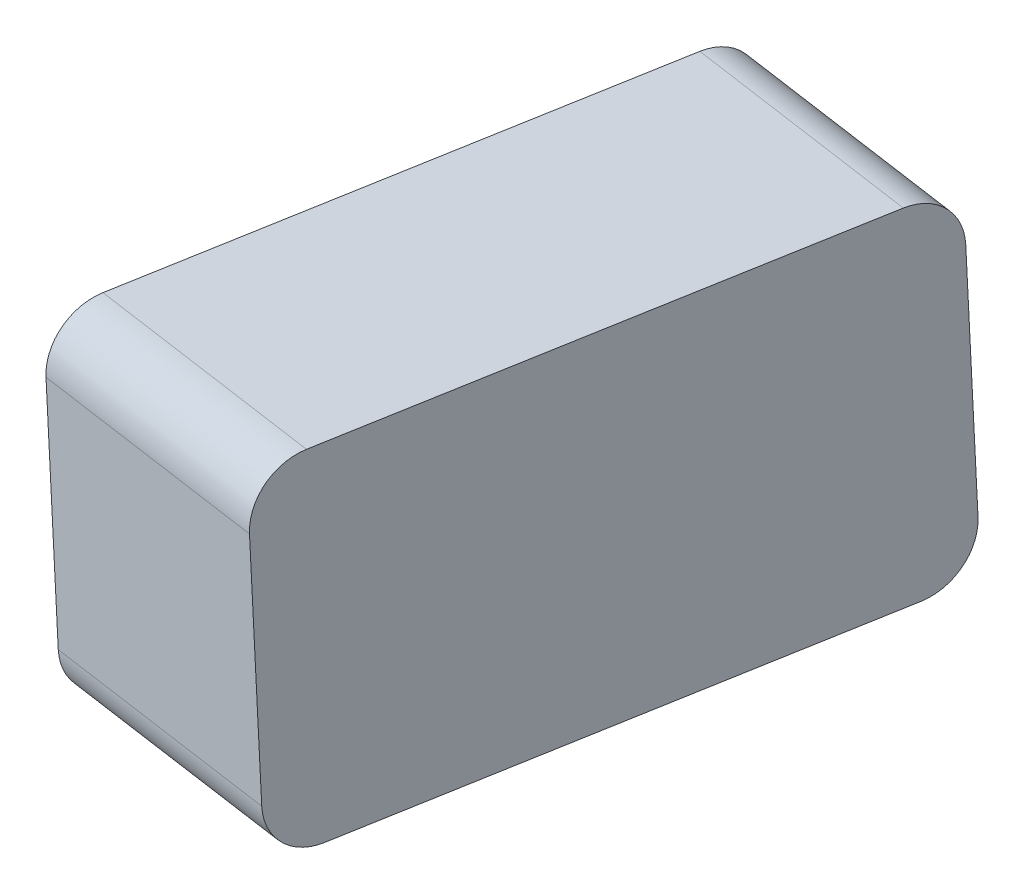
ISO-10303-21;
HEADER;
FILE_DESCRIPTION(('STEP AP214'),'2;1');
FILE_NAME('part.step','',(''),(''),'','','');
FILE_SCHEMA(('AUTOMOTIVE_DESIGN { 1 0 10303 214 1 1 1 1 }'));
ENDSEC;
DATA;
#1=APPLICATION_CONTEXT('core data for automotive mechanical design processes');
#2=APPLICATION_PROTOCOL_DEFINITION('international standard','automotive_design',2000,#1);
#3=PRODUCT_CONTEXT('',#1,'mechanical');
#4=PRODUCT('Part','Part','',(#3));
#5=PRODUCT_RELATED_PRODUCT_CATEGORY('part','',(#4));
#6=PRODUCT_DEFINITION_FORMATION('','',#4);
#7=PRODUCT_DEFINITION_CONTEXT('part definition',#1,'design');
#8=PRODUCT_DEFINITION('design','',#6,#7);
#9=PRODUCT_DEFINITION_SHAPE('','',#8);
#10=(LENGTH_UNIT() NAMED_UNIT(*) SI_UNIT(.MILLI.,.METRE.));
#11=(NAMED_UNIT(*) PLANE_ANGLE_UNIT() SI_UNIT($,.RADIAN.));
#12=(NAMED_UNIT(*) SI_UNIT($,.STERADIAN.) SOLID_ANGLE_UNIT());
#13=UNCERTAINTY_MEASURE_WITH_UNIT(LENGTH_MEASURE(1.E-05),#10,'distance_accuracy_value','');
#14=(GEOMETRIC_REPRESENTATION_CONTEXT(3) GLOBAL_UNCERTAINTY_ASSIGNED_CONTEXT((#13)) GLOBAL_UNIT_ASSIGNED_CONTEXT((#10,
#11,#12)) REPRESENTATION_CONTEXT('',''));
#15=CARTESIAN_POINT('',(0.,0.,0.));
#16=DIRECTION('',(0.,0.,1.));
#17=DIRECTION('',(1.,0.,0.));
#18=AXIS2_PLACEMENT_3D('',#15,#16,#17);
#19=CARTESIAN_POINT('',(186.967647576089,90.0851409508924,-29.5540646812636));
#20=DIRECTION('',(0.981314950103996,0.0523359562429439,0.185153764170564));
#21=DIRECTION('',(-0.185407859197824,0.,0.982661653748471));
#22=AXIS2_PLACEMENT_3D('',#19,#20,#21);
#23=PLANE('',#22);
#24=CARTESIAN_POINT('',(186.967647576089,90.0851409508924,-29.5540646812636));
#25=DIRECTION('',(-0.981314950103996,-0.0523359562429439,-0.185153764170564));
#26=DIRECTION('',(-0.185407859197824,0.,0.982661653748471));
#27=AXIS2_PLACEMENT_3D('',#24,#25,#26);
#28=CIRCLE('',#27,9.99999999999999);
#29=CARTESIAN_POINT('',(188.816557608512,90.1837479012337,-39.3811603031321));
#30=VERTEX_POINT('',#29);
#31=CARTESIAN_POINT('',(187.500215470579,80.0993324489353,-29.5540646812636));
#32=VERTEX_POINT('',#31);
#33=EDGE_CURVE('E169',#30,#32,#28,.T.);
#34=ORIENTED_EDGE('',*,*,#33,.T.);
#35=DIRECTION('',(-0.184891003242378,-0.00986069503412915,0.98270956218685));
#36=VECTOR('',#35,1.);
#37=CARTESIAN_POINT('',(187.500215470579,80.0993324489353,-29.5540646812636));
#38=LINE('',#37,#36);
#39=CARTESIAN_POINT('',(169.011115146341,79.1132629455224,68.7168915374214));
#40=VERTEX_POINT('',#39);
#41=EDGE_CURVE('E173',#32,#40,#38,.T.);
#42=ORIENTED_EDGE('',*,*,#41,.T.);
#43=CARTESIAN_POINT('',(168.478547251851,89.0990714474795,68.7168915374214));
#44=DIRECTION('',(-0.981314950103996,-0.0523359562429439,-0.185153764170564));
#45=DIRECTION('',(-0.185407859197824,0.,0.982661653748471));
#46=AXIS2_PLACEMENT_3D('',#43,#44,#45);
#47=CIRCLE('',#46,9.99999999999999);
#48=CARTESIAN_POINT('',(166.629637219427,89.0004644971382,78.5439871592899));
#49=VERTEX_POINT('',#48);
#50=EDGE_CURVE('E235',#40,#49,#47,.T.);
#51=ORIENTED_EDGE('',*,*,#50,.T.);
#52=DIRECTION('',(-0.053256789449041,0.998580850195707,0.));
#53=VECTOR('',#52,1.);
#54=CARTESIAN_POINT('',(164.23308169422,133.936602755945,78.5439871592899));
#55=LINE('',#54,#53);
#56=CARTESIAN_POINT('',(164.23308169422,133.936602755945,78.5439871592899));
#57=VERTEX_POINT('',#56);
#58=EDGE_CURVE('E238',#49,#57,#55,.T.);
#59=ORIENTED_EDGE('',*,*,#58,.T.);
#60=CARTESIAN_POINT('',(166.081991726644,134.035209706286,68.7168915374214));
#61=DIRECTION('',(-0.981314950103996,-0.0523359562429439,-0.185153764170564));
#62=DIRECTION('',(0.185407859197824,0.,-0.982661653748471));
#63=AXIS2_PLACEMENT_3D('',#60,#61,#62);
#64=CIRCLE('',#63,10.);
#65=CARTESIAN_POINT('',(165.549423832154,144.021018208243,68.7168915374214));
#66=VERTEX_POINT('',#65);
#67=EDGE_CURVE('E241',#57,#66,#64,.T.);
#68=ORIENTED_EDGE('',*,*,#67,.T.);
#69=DIRECTION('',(0.184891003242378,0.00986069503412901,-0.98270956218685));
#70=VECTOR('',#69,1.);
#71=CARTESIAN_POINT('',(184.038524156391,145.007087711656,-29.5540646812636));
#72=LINE('',#71,#70);
#73=CARTESIAN_POINT('',(184.038524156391,145.007087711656,-29.5540646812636));
#74=VERTEX_POINT('',#73);
#75=EDGE_CURVE('E244',#66,#74,#72,.T.);
#76=ORIENTED_EDGE('',*,*,#75,.T.);
#77=CARTESIAN_POINT('',(184.571092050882,135.021279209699,-29.5540646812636));
#78=DIRECTION('',(-0.981314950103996,-0.0523359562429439,-0.185153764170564));
#79=DIRECTION('',(-0.185407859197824,0.,0.982661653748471));
#80=AXIS2_PLACEMENT_3D('',#77,#78,#79);
#81=CIRCLE('',#80,10.);
#82=CARTESIAN_POINT('',(186.420002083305,135.11988616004,-39.3811603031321));
#83=VERTEX_POINT('',#82);
#84=EDGE_CURVE('E247',#74,#83,#81,.T.);
#85=ORIENTED_EDGE('',*,*,#84,.T.);
#86=DIRECTION('',(0.0532567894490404,-0.998580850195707,0.));
#87=VECTOR('',#86,1.);
#88=CARTESIAN_POINT('',(186.420002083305,135.11988616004,-39.3811603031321));
#89=LINE('',#88,#87);
#90=EDGE_CURVE('E212',#83,#30,#89,.T.);
#91=ORIENTED_EDGE('',*,*,#90,.T.);
#92=EDGE_LOOP('',(#34,#42,#51,#59,#68,#76,#85,#91));
#93=FACE_BOUND('',#92,.T.);
#94=CARTESIAN_POINT('',(182.195634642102,124.880378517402,-14.0976918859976));
#95=DIRECTION('',(0.981314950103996,0.0523359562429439,0.185153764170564));
#96=DIRECTION('',(0.185407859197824,0.,-0.982661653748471));
#97=AXIS2_PLACEMENT_3D('',#94,#95,#96);
#98=CIRCLE('',#97,9.99999999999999);
#99=CARTESIAN_POINT('',(184.024832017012,125.327425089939,-23.9188011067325));
#100=VERTEX_POINT('',#99);
#101=CARTESIAN_POINT('',(181.663066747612,134.866187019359,-14.0976918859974));
#102=VERTEX_POINT('',#101);
#103=EDGE_CURVE('E178',#100,#102,#98,.T.);
#104=ORIENTED_EDGE('',*,*,#103,.T.);
#105=DIRECTION('',(-0.184891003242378,-0.00986069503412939,0.98270956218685));
#106=VECTOR('',#105,1.);
#107=CARTESIAN_POINT('',(181.663066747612,134.866187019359,-14.0976918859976));
#108=LINE('',#107,#106);
#109=CARTESIAN_POINT('',(169.174908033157,134.200162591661,52.2778091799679));
#110=VERTEX_POINT('',#109);
#111=EDGE_CURVE('E193',#102,#110,#108,.T.);
#112=ORIENTED_EDGE('',*,*,#111,.T.);
#113=CARTESIAN_POINT('',(169.707475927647,124.214354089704,52.277809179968));
#114=DIRECTION('',(0.981314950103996,0.0523359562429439,0.185153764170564));
#115=DIRECTION('',(0.185407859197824,0.,-0.982661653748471));
#116=AXIS2_PLACEMENT_3D('',#113,#114,#115);
#117=CIRCLE('',#116,9.99999999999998);
#118=CARTESIAN_POINT('',(167.841105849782,124.464306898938,62.0989184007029));
#119=VERTEX_POINT('',#118);
#120=EDGE_CURVE('E195',#110,#119,#117,.T.);
#121=ORIENTED_EDGE('',*,*,#120,.T.);
#122=DIRECTION('',(0.0467717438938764,-0.998316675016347,0.0342960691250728));
#123=VECTOR('',#122,1.);
#124=CARTESIAN_POINT('',(167.841105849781,124.464306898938,62.0989184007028));
#125=LINE('',#124,#123);
#126=CARTESIAN_POINT('',(169.011112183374,99.4911770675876,62.9568427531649));
#127=VERTEX_POINT('',#126);
#128=EDGE_CURVE('E198',#119,#127,#125,.T.);
#129=ORIENTED_EDGE('',*,*,#128,.T.);
#130=CARTESIAN_POINT('',(170.87748226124,99.2412242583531,53.1357335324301));
#131=DIRECTION('',(0.981314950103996,0.0523359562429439,0.185153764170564));
#132=DIRECTION('',(0.185407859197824,0.,-0.982661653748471));
#133=AXIS2_PLACEMENT_3D('',#130,#131,#132);
#134=CIRCLE('',#133,9.9999999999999);
#135=CARTESIAN_POINT('',(171.41005015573,89.2554157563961,53.13573353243));
#136=VERTEX_POINT('',#135);
#137=EDGE_CURVE('E201',#127,#136,#134,.T.);
#138=ORIENTED_EDGE('',*,*,#137,.T.);
#139=DIRECTION('',(0.184891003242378,0.00986069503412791,-0.98270956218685));
#140=VECTOR('',#139,1.);
#141=CARTESIAN_POINT('',(171.41005015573,89.2554157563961,53.13573353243));
#142=LINE('',#141,#140);
#143=CARTESIAN_POINT('',(184.221035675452,89.9386573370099,-14.9556162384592));
#144=VERTEX_POINT('',#143);
#145=EDGE_CURVE('E204',#136,#144,#142,.T.);
#146=ORIENTED_EDGE('',*,*,#145,.T.);
#147=CARTESIAN_POINT('',(183.688467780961,99.924465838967,-14.9556162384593));
#148=DIRECTION('',(0.981314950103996,0.0523359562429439,0.185153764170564));
#149=DIRECTION('',(0.185407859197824,0.,-0.982661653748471));
#150=AXIS2_PLACEMENT_3D('',#147,#148,#149);
#151=CIRCLE('',#150,10.);
#152=CARTESIAN_POINT('',(185.517665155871,100.371512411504,-24.7767254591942));
#153=VERTEX_POINT('',#152);
#154=EDGE_CURVE('E164',#144,#153,#151,.T.);
#155=ORIENTED_EDGE('',*,*,#154,.T.);
#156=DIRECTION('',(-0.0596769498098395,0.997628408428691,0.0342960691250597));
#157=VECTOR('',#156,1.);
#158=CARTESIAN_POINT('',(185.517665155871,100.371512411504,-24.7767254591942));
#159=LINE('',#158,#157);
#160=EDGE_CURVE('E155',#153,#100,#159,.T.);
#161=ORIENTED_EDGE('',*,*,#160,.T.);
#162=EDGE_LOOP('',(#104,#112,#121,#129,#138,#146,#155,#161));
#163=FACE_BOUND('',#162,.T.);
#164=ADVANCED_FACE('F32',(#93,#163),#23,.F.);
#165=CARTESIAN_POINT('',(236.033395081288,92.7019387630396,-20.2963764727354));
#166=DIRECTION('',(-0.981314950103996,-0.0523359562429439,-0.185153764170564));
#167=DIRECTION('',(0.185407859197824,0.,-0.982661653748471));
#168=AXIS2_PLACEMENT_3D('',#165,#166,#167);
#169=CYLINDRICAL_SURFACE('',#168,9.99999999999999);
#170=ORIENTED_EDGE('',*,*,#33,.F.);
#171=DIRECTION('',(-0.981314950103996,-0.0523359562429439,-0.185153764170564));
#172=VECTOR('',#171,1.);
#173=CARTESIAN_POINT('',(237.882305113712,92.8005457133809,-30.1234720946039));
#174=LINE('',#173,#172);
#175=CARTESIAN_POINT('',(237.882305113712,92.8005457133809,-30.1234720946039));
#176=VERTEX_POINT('',#175);
#177=EDGE_CURVE('E231',#176,#30,#174,.T.);
#178=ORIENTED_EDGE('',*,*,#177,.F.);
#179=CARTESIAN_POINT('',(236.033395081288,92.7019387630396,-20.2963764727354));
#180=DIRECTION('',(-0.981314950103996,-0.0523359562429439,-0.185153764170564));
#181=DIRECTION('',(-0.185407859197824,0.,0.982661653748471));
#182=AXIS2_PLACEMENT_3D('',#179,#180,#181);
#183=CIRCLE('',#182,9.99999999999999);
#184=CARTESIAN_POINT('',(236.565962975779,82.7161302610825,-20.2963764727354));
#185=VERTEX_POINT('',#184);
#186=EDGE_CURVE('E208',#176,#185,#183,.T.);
#187=ORIENTED_EDGE('',*,*,#186,.T.);
#188=DIRECTION('',(-0.981314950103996,-0.0523359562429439,-0.185153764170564));
#189=VECTOR('',#188,1.);
#190=CARTESIAN_POINT('',(236.565962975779,82.7161302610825,-20.2963764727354));
#191=LINE('',#190,#189);
#192=EDGE_CURVE('E11',#185,#32,#191,.T.);
#193=ORIENTED_EDGE('',*,*,#192,.T.);
#194=EDGE_LOOP('',(#170,#178,#187,#193));
#195=FACE_BOUND('',#194,.T.);
#196=ADVANCED_FACE('F34',(#195),#169,.T.);
#197=CARTESIAN_POINT('',(236.565962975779,82.7161302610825,-20.2963764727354));
#198=DIRECTION('',(-0.0532567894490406,0.998580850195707,0.));
#199=DIRECTION('',(0.998580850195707,0.0532567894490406,0.));
#200=AXIS2_PLACEMENT_3D('',#197,#198,#199);
#201=PLANE('',#200);
#202=ORIENTED_EDGE('',*,*,#41,.F.);
#203=ORIENTED_EDGE('',*,*,#192,.F.);
#204=DIRECTION('',(-0.184891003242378,-0.00986069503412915,0.98270956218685));
#205=VECTOR('',#204,1.);
#206=CARTESIAN_POINT('',(236.565962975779,82.7161302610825,-20.2963764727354));
#207=LINE('',#206,#205);
#208=CARTESIAN_POINT('',(218.076862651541,81.7300607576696,77.9745797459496));
#209=VERTEX_POINT('',#208);
#210=EDGE_CURVE('E211',#185,#209,#207,.T.);
#211=ORIENTED_EDGE('',*,*,#210,.T.);
#212=DIRECTION('',(-0.981314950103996,-0.0523359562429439,-0.185153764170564));
#213=VECTOR('',#212,1.);
#214=CARTESIAN_POINT('',(218.076862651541,81.7300607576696,77.9745797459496));
#215=LINE('',#214,#213);
#216=EDGE_CURVE('E40',#209,#40,#215,.T.);
#217=ORIENTED_EDGE('',*,*,#216,.T.);
#218=EDGE_LOOP('',(#202,#203,#211,#217));
#219=FACE_BOUND('',#218,.T.);
#220=ADVANCED_FACE('F266',(#219),#201,.F.);
#221=CARTESIAN_POINT('',(217.544294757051,91.7158692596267,77.9745797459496));
#222=DIRECTION('',(-0.981314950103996,-0.0523359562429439,-0.185153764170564));
#223=DIRECTION('',(0.185407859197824,0.,-0.982661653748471));
#224=AXIS2_PLACEMENT_3D('',#221,#222,#223);
#225=CYLINDRICAL_SURFACE('',#224,9.99999999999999);
#226=ORIENTED_EDGE('',*,*,#50,.F.);
#227=ORIENTED_EDGE('',*,*,#216,.F.);
#228=CARTESIAN_POINT('',(217.544294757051,91.7158692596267,77.9745797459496));
#229=DIRECTION('',(-0.981314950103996,-0.0523359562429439,-0.185153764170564));
#230=DIRECTION('',(-0.185407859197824,0.,0.982661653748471));
#231=AXIS2_PLACEMENT_3D('',#228,#229,#230);
#232=CIRCLE('',#231,9.99999999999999);
#233=CARTESIAN_POINT('',(215.695384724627,91.6172623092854,87.8016753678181));
#234=VERTEX_POINT('',#233);
#235=EDGE_CURVE('E215',#209,#234,#232,.T.);
#236=ORIENTED_EDGE('',*,*,#235,.T.);
#237=DIRECTION('',(-0.981314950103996,-0.0523359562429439,-0.185153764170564));
#238=VECTOR('',#237,1.);
#239=CARTESIAN_POINT('',(215.695384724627,91.6172623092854,87.8016753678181));
#240=LINE('',#239,#238);
#241=EDGE_CURVE('E261',#234,#49,#240,.T.);
#242=ORIENTED_EDGE('',*,*,#241,.T.);
#243=EDGE_LOOP('',(#226,#227,#236,#242));
#244=FACE_BOUND('',#243,.T.);
#245=ADVANCED_FACE('F269',(#244),#225,.T.);
#246=CARTESIAN_POINT('',(213.29882919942,136.553400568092,87.8016753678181));
#247=DIRECTION('',(0.184891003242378,0.00986069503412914,-0.98270956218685));
#248=DIRECTION('',(0.982757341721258,0.,0.184899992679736));
#249=AXIS2_PLACEMENT_3D('',#246,#247,#248);
#250=PLANE('',#249);
#251=ORIENTED_EDGE('',*,*,#58,.F.);
#252=ORIENTED_EDGE('',*,*,#241,.F.);
#253=DIRECTION('',(-0.053256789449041,0.998580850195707,0.));
#254=VECTOR('',#253,1.);
#255=CARTESIAN_POINT('',(213.29882919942,136.553400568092,87.8016753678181));
#256=LINE('',#255,#254);
#257=CARTESIAN_POINT('',(213.29882919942,136.553400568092,87.8016753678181));
#258=VERTEX_POINT('',#257);
#259=EDGE_CURVE('E218',#234,#258,#256,.T.);
#260=ORIENTED_EDGE('',*,*,#259,.T.);
#261=DIRECTION('',(-0.981314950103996,-0.0523359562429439,-0.185153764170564));
#262=VECTOR('',#261,1.);
#263=CARTESIAN_POINT('',(213.29882919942,136.553400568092,87.8016753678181));
#264=LINE('',#263,#262);
#265=EDGE_CURVE('E259',#258,#57,#264,.T.);
#266=ORIENTED_EDGE('',*,*,#265,.T.);
#267=EDGE_LOOP('',(#251,#252,#260,#266));
#268=FACE_BOUND('',#267,.T.);
#269=ADVANCED_FACE('F284',(#268),#250,.F.);
#270=CARTESIAN_POINT('',(215.147739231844,136.652007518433,77.9745797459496));
#271=DIRECTION('',(-0.981314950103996,-0.0523359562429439,-0.185153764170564));
#272=DIRECTION('',(0.185407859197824,0.,-0.982661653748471));
#273=AXIS2_PLACEMENT_3D('',#270,#271,#272);
#274=CYLINDRICAL_SURFACE('',#273,10.);
#275=ORIENTED_EDGE('',*,*,#67,.F.);
#276=ORIENTED_EDGE('',*,*,#265,.F.);
#277=CARTESIAN_POINT('',(215.147739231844,136.652007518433,77.9745797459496));
#278=DIRECTION('',(-0.981314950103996,-0.0523359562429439,-0.185153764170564));
#279=DIRECTION('',(0.185407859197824,0.,-0.982661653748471));
#280=AXIS2_PLACEMENT_3D('',#277,#278,#279);
#281=CIRCLE('',#280,10.);
#282=CARTESIAN_POINT('',(214.615171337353,146.637816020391,77.9745797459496));
#283=VERTEX_POINT('',#282);
#284=EDGE_CURVE('E221',#258,#283,#281,.T.);
#285=ORIENTED_EDGE('',*,*,#284,.T.);
#286=DIRECTION('',(-0.981314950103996,-0.0523359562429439,-0.185153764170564));
#287=VECTOR('',#286,1.);
#288=CARTESIAN_POINT('',(214.615171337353,146.637816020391,77.9745797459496));
#289=LINE('',#288,#287);
#290=EDGE_CURVE('E257',#283,#66,#289,.T.);
#291=ORIENTED_EDGE('',*,*,#290,.T.);
#292=EDGE_LOOP('',(#275,#276,#285,#291));
#293=FACE_BOUND('',#292,.T.);
#294=ADVANCED_FACE('F288',(#293),#274,.T.);
#295=CARTESIAN_POINT('',(233.104271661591,147.623885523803,-20.2963764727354));
#296=DIRECTION('',(0.0532567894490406,-0.998580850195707,0.));
#297=DIRECTION('',(-0.998580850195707,-0.0532567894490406,0.));
#298=AXIS2_PLACEMENT_3D('',#295,#296,#297);
#299=PLANE('',#298);
#300=ORIENTED_EDGE('',*,*,#75,.F.);
#301=ORIENTED_EDGE('',*,*,#290,.F.);
#302=DIRECTION('',(0.184891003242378,0.00986069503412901,-0.98270956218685));
#303=VECTOR('',#302,1.);
#304=CARTESIAN_POINT('',(233.104271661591,147.623885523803,-20.2963764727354));
#305=LINE('',#304,#303);
#306=CARTESIAN_POINT('',(233.104271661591,147.623885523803,-20.2963764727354));
#307=VERTEX_POINT('',#306);
#308=EDGE_CURVE('E224',#283,#307,#305,.T.);
#309=ORIENTED_EDGE('',*,*,#308,.T.);
#310=DIRECTION('',(-0.981314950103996,-0.0523359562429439,-0.185153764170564));
#311=VECTOR('',#310,1.);
#312=CARTESIAN_POINT('',(233.104271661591,147.623885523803,-20.2963764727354));
#313=LINE('',#312,#311);
#314=EDGE_CURVE('E255',#307,#74,#313,.T.);
#315=ORIENTED_EDGE('',*,*,#314,.T.);
#316=EDGE_LOOP('',(#300,#301,#309,#315));
#317=FACE_BOUND('',#316,.T.);
#318=ADVANCED_FACE('F291',(#317),#299,.F.);
#319=CARTESIAN_POINT('',(233.636839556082,137.638077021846,-20.2963764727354));
#320=DIRECTION('',(-0.981314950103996,-0.0523359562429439,-0.185153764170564));
#321=DIRECTION('',(0.185407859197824,0.,-0.982661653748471));
#322=AXIS2_PLACEMENT_3D('',#319,#320,#321);
#323=CYLINDRICAL_SURFACE('',#322,10.);
#324=ORIENTED_EDGE('',*,*,#84,.F.);
#325=ORIENTED_EDGE('',*,*,#314,.F.);
#326=CARTESIAN_POINT('',(233.636839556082,137.638077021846,-20.2963764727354));
#327=DIRECTION('',(-0.981314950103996,-0.0523359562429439,-0.185153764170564));
#328=DIRECTION('',(-0.185407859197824,0.,0.982661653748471));
#329=AXIS2_PLACEMENT_3D('',#326,#327,#328);
#330=CIRCLE('',#329,10.);
#331=CARTESIAN_POINT('',(235.485749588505,137.736683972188,-30.1234720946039));
#332=VERTEX_POINT('',#331);
#333=EDGE_CURVE('E227',#307,#332,#330,.T.);
#334=ORIENTED_EDGE('',*,*,#333,.T.);
#335=DIRECTION('',(-0.981314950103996,-0.0523359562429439,-0.185153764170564));
#336=VECTOR('',#335,1.);
#337=CARTESIAN_POINT('',(235.485749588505,137.736683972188,-30.1234720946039));
#338=LINE('',#337,#336);
#339=EDGE_CURVE('E253',#332,#83,#338,.T.);
#340=ORIENTED_EDGE('',*,*,#339,.T.);
#341=EDGE_LOOP('',(#324,#325,#334,#340));
#342=FACE_BOUND('',#341,.T.);
#343=ADVANCED_FACE('F295',(#342),#323,.T.);
#344=CARTESIAN_POINT('',(235.485749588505,137.736683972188,-30.1234720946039));
#345=DIRECTION('',(-0.184891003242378,-0.00986069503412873,0.98270956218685));
#346=DIRECTION('',(-0.982757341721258,0.,-0.184899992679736));
#347=AXIS2_PLACEMENT_3D('',#344,#345,#346);
#348=PLANE('',#347);
#349=ORIENTED_EDGE('',*,*,#90,.F.);
#350=ORIENTED_EDGE('',*,*,#339,.F.);
#351=DIRECTION('',(0.0532567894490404,-0.998580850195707,0.));
#352=VECTOR('',#351,1.);
#353=CARTESIAN_POINT('',(235.485749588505,137.736683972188,-30.1234720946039));
#354=LINE('',#353,#352);
#355=EDGE_CURVE('E230',#332,#176,#354,.T.);
#356=ORIENTED_EDGE('',*,*,#355,.T.);
#357=ORIENTED_EDGE('',*,*,#177,.T.);
#358=EDGE_LOOP('',(#349,#350,#356,#357));
#359=FACE_BOUND('',#358,.T.);
#360=ADVANCED_FACE('F297',(#359),#348,.F.);
#361=CARTESIAN_POINT('',(236.033395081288,92.7019387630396,-20.2963764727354));
#362=DIRECTION('',(0.981314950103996,0.0523359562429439,0.185153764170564));
#363=DIRECTION('',(-0.185407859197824,0.,0.982661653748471));
#364=AXIS2_PLACEMENT_3D('',#361,#362,#363);
#365=PLANE('',#364);
#366=ORIENTED_EDGE('',*,*,#186,.F.);
#367=ORIENTED_EDGE('',*,*,#355,.F.);
#368=ORIENTED_EDGE('',*,*,#333,.F.);
#369=ORIENTED_EDGE('',*,*,#308,.F.);
#370=ORIENTED_EDGE('',*,*,#284,.F.);
#371=ORIENTED_EDGE('',*,*,#259,.F.);
#372=ORIENTED_EDGE('',*,*,#235,.F.);
#373=ORIENTED_EDGE('',*,*,#210,.F.);
#374=EDGE_LOOP('',(#366,#367,#368,#369,#370,#371,#372,#373));
#375=FACE_BOUND('',#374,.T.);
#376=ADVANCED_FACE('F280',(#375),#365,.T.);
#377=CARTESIAN_POINT('',(182.195634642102,124.880378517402,-14.0976918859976));
#378=DIRECTION('',(0.981314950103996,0.0523359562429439,0.185153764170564));
#379=DIRECTION('',(0.185407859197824,0.,-0.982661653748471));
#380=AXIS2_PLACEMENT_3D('',#377,#378,#379);
#381=CONICAL_SURFACE('',#380,9.99999999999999,0.05235987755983);
#382=CARTESIAN_POINT('',(178.270374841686,124.67103469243,-14.8383069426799));
#383=DIRECTION('',(-0.981314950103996,-0.0523359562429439,-0.185153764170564));
#384=DIRECTION('',(-0.185407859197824,0.,0.982661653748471));
#385=AXIS2_PLACEMENT_3D('',#382,#383,#384);
#386=CIRCLE('',#385,9.79036888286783);
#387=CARTESIAN_POINT('',(180.06122654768,125.108709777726,-24.4535351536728));
#388=VERTEX_POINT('',#387);
#389=CARTESIAN_POINT('',(177.748971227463,134.447509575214,-14.8383069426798));
#390=VERTEX_POINT('',#389);
#391=EDGE_CURVE('E152',#388,#390,#386,.F.);
#392=ORIENTED_EDGE('',*,*,#391,.T.);
#393=DIRECTION('',(0.977182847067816,0.104525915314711,0.184900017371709));
#394=VECTOR('',#393,1.);
#395=CARTESIAN_POINT('',(181.663066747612,134.866187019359,-14.0976918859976));
#396=LINE('',#395,#394);
#397=EDGE_CURVE('E47',#390,#102,#396,.T.);
#398=ORIENTED_EDGE('',*,*,#397,.T.);
#399=ORIENTED_EDGE('',*,*,#103,.F.);
#400=DIRECTION('',(0.989543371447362,0.0546038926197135,0.133500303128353));
#401=VECTOR('',#400,1.);
#402=CARTESIAN_POINT('',(184.024832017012,125.327425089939,-23.9188011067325));
#403=LINE('',#402,#401);
#404=EDGE_CURVE('E206',#388,#100,#403,.T.);
#405=ORIENTED_EDGE('',*,*,#404,.F.);
#406=EDGE_LOOP('',(#392,#398,#399,#405));
#407=FACE_BOUND('',#406,.T.);
#408=ADVANCED_FACE('F304',(#407),#381,.T.);
#409=CARTESIAN_POINT('',(181.663066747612,134.866187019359,-14.0976918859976));
#410=DIRECTION('',(-0.104541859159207,0.994473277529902,-0.00969019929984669));
#411=DIRECTION('',(0.994519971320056,0.104546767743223,0.));
#412=AXIS2_PLACEMENT_3D('',#409,#410,#411);
#413=PLANE('',#412);
#414=DIRECTION('',(-0.184891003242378,-0.0098606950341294,0.98270956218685));
#415=VECTOR('',#414,1.);
#416=CARTESIAN_POINT('',(177.748971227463,134.447509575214,-14.8383069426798));
#417=LINE('',#416,#415);
#418=CARTESIAN_POINT('',(165.260812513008,133.781485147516,51.5371941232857));
#419=VERTEX_POINT('',#418);
#420=EDGE_CURVE('E189',#390,#419,#417,.T.);
#421=ORIENTED_EDGE('',*,*,#420,.T.);
#422=DIRECTION('',(0.977182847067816,0.104525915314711,0.184900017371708));
#423=VECTOR('',#422,1.);
#424=CARTESIAN_POINT('',(169.174908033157,134.200162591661,52.2778091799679));
#425=LINE('',#424,#423);
#426=EDGE_CURVE('E54',#419,#110,#425,.T.);
#427=ORIENTED_EDGE('',*,*,#426,.T.);
#428=ORIENTED_EDGE('',*,*,#111,.F.);
#429=ORIENTED_EDGE('',*,*,#397,.F.);
#430=EDGE_LOOP('',(#421,#427,#428,#429));
#431=FACE_BOUND('',#430,.T.);
#432=ADVANCED_FACE('F317',(#431),#413,.T.);
#433=CARTESIAN_POINT('',(169.707475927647,124.214354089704,52.277809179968));
#434=DIRECTION('',(0.981314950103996,0.0523359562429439,0.185153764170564));
#435=DIRECTION('',(0.185407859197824,0.,-0.982661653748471));
#436=AXIS2_PLACEMENT_3D('',#433,#434,#435);
#437=CONICAL_SURFACE('',#436,9.99999999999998,0.05235987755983);
#438=CARTESIAN_POINT('',(165.782216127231,124.005010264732,51.5371941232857));
#439=DIRECTION('',(-0.981314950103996,-0.0523359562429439,-0.185153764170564));
#440=DIRECTION('',(-0.185407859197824,0.,0.982661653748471));
#441=AXIS2_PLACEMENT_3D('',#438,#439,#440);
#442=CIRCLE('',#441,9.79036888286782);
#443=CARTESIAN_POINT('',(163.954970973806,124.249723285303,61.1524223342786));
#444=VERTEX_POINT('',#443);
#445=EDGE_CURVE('E186',#419,#444,#442,.F.);
#446=ORIENTED_EDGE('',*,*,#445,.T.);
#447=DIRECTION('',(0.97020226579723,0.0535723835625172,0.236299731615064));
#448=VECTOR('',#447,1.);
#449=CARTESIAN_POINT('',(167.841105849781,124.464306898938,62.0989184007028));
#450=LINE('',#449,#448);
#451=EDGE_CURVE('E196',#444,#119,#450,.T.);
#452=ORIENTED_EDGE('',*,*,#451,.T.);
#453=ORIENTED_EDGE('',*,*,#120,.F.);
#454=ORIENTED_EDGE('',*,*,#426,.F.);
#455=EDGE_LOOP('',(#446,#452,#453,#454));
#456=FACE_BOUND('',#455,.T.);
#457=ADVANCED_FACE('F320',(#456),#437,.T.);
#458=CARTESIAN_POINT('',(167.841105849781,124.464306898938,62.0989184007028));
#459=DIRECTION('',(-0.237739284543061,0.0222219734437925,0.971074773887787));
#460=DIRECTION('',(-0.971314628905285,0.,-0.237798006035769));
#461=AXIS2_PLACEMENT_3D('',#458,#459,#460);
#462=PLANE('',#461);
#463=DIRECTION('',(0.0467717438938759,-0.998316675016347,0.0342960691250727));
#464=VECTOR('',#463,1.);
#465=CARTESIAN_POINT('',(163.954970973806,124.249723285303,61.1524223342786));
#466=LINE('',#465,#464);
#467=CARTESIAN_POINT('',(165.124977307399,99.2765934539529,62.0103466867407));
#468=VERTEX_POINT('',#467);
#469=EDGE_CURVE('E183',#444,#468,#466,.T.);
#470=ORIENTED_EDGE('',*,*,#469,.T.);
#471=DIRECTION('',(0.97020226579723,0.0535723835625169,0.236299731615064));
#472=VECTOR('',#471,1.);
#473=CARTESIAN_POINT('',(169.011112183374,99.4911770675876,62.9568427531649));
#474=LINE('',#473,#472);
#475=EDGE_CURVE('E199',#468,#127,#474,.T.);
#476=ORIENTED_EDGE('',*,*,#475,.T.);
#477=ORIENTED_EDGE('',*,*,#128,.F.);
#478=ORIENTED_EDGE('',*,*,#451,.F.);
#479=EDGE_LOOP('',(#470,#476,#477,#478));
#480=FACE_BOUND('',#479,.T.);
#481=ADVANCED_FACE('F323',(#480),#462,.T.);
#482=CARTESIAN_POINT('',(170.87748226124,99.2412242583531,53.1357335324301));
#483=DIRECTION('',(0.981314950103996,0.0523359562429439,0.185153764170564));
#484=DIRECTION('',(0.185407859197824,0.,-0.982661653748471));
#485=AXIS2_PLACEMENT_3D('',#482,#483,#484);
#486=CONICAL_SURFACE('',#485,9.9999999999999,0.05235987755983);
#487=CARTESIAN_POINT('',(166.952222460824,99.0318804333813,52.3951184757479));
#488=DIRECTION('',(-0.981314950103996,-0.0523359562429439,-0.185153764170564));
#489=DIRECTION('',(-0.185407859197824,0.,0.982661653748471));
#490=AXIS2_PLACEMENT_3D('',#487,#488,#489);
#491=CIRCLE('',#490,9.79036888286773);
#492=CARTESIAN_POINT('',(167.473626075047,89.2554055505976,52.3951184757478));
#493=VERTEX_POINT('',#492);
#494=EDGE_CURVE('E175',#468,#493,#491,.F.);
#495=ORIENTED_EDGE('',*,*,#494,.T.);
#496=DIRECTION('',(0.982757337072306,2.54795294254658E-06,0.184900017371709));
#497=VECTOR('',#496,1.);
#498=CARTESIAN_POINT('',(171.41005015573,89.2554157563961,53.13573353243));
#499=LINE('',#498,#497);
#500=EDGE_CURVE('E202',#493,#136,#499,.T.);
#501=ORIENTED_EDGE('',*,*,#500,.T.);
#502=ORIENTED_EDGE('',*,*,#137,.F.);
#503=ORIENTED_EDGE('',*,*,#475,.F.);
#504=EDGE_LOOP('',(#495,#501,#502,#503));
#505=FACE_BOUND('',#504,.T.);
#506=ADVANCED_FACE('F327',(#505),#486,.T.);
#507=CARTESIAN_POINT('',(171.41005015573,89.2554157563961,53.13573353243));
#508=DIRECTION('',(0.00182574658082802,-0.999951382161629,-0.00969019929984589));
#509=DIRECTION('',(0.,0.00969021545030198,-0.999953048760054));
#510=AXIS2_PLACEMENT_3D('',#507,#508,#509);
#511=PLANE('',#510);
#512=DIRECTION('',(0.184891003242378,0.0098606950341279,-0.98270956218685));
#513=VECTOR('',#512,1.);
#514=CARTESIAN_POINT('',(167.473626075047,89.2554055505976,52.3951184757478));
#515=LINE('',#514,#513);
#516=CARTESIAN_POINT('',(180.284611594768,89.9386471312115,-15.6962312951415));
#517=VERTEX_POINT('',#516);
#518=EDGE_CURVE('E170',#493,#517,#515,.T.);
#519=ORIENTED_EDGE('',*,*,#518,.T.);
#520=DIRECTION('',(0.982757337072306,2.54795294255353E-06,0.184900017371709));
#521=VECTOR('',#520,1.);
#522=CARTESIAN_POINT('',(184.221035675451,89.9386573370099,-14.9556162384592));
#523=LINE('',#522,#521);
#524=EDGE_CURVE('E167',#517,#144,#523,.T.);
#525=ORIENTED_EDGE('',*,*,#524,.T.);
#526=ORIENTED_EDGE('',*,*,#145,.F.);
#527=ORIENTED_EDGE('',*,*,#500,.F.);
#528=EDGE_LOOP('',(#519,#525,#526,#527));
#529=FACE_BOUND('',#528,.T.);
#530=ADVANCED_FACE('F331',(#529),#511,.T.);
#531=CARTESIAN_POINT('',(183.688467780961,99.924465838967,-14.9556162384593));
#532=DIRECTION('',(0.981314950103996,0.0523359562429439,0.185153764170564));
#533=DIRECTION('',(0.185407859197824,0.,-0.982661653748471));
#534=AXIS2_PLACEMENT_3D('',#531,#532,#533);
#535=CONICAL_SURFACE('',#534,10.,0.05235987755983);
#536=CARTESIAN_POINT('',(179.763207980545,99.7151220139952,-15.6962312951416));
#537=DIRECTION('',(-0.981314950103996,-0.0523359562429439,-0.185153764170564));
#538=DIRECTION('',(-0.185407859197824,0.,0.982661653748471));
#539=AXIS2_PLACEMENT_3D('',#536,#537,#538);
#540=CIRCLE('',#539,9.79036888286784);
#541=CARTESIAN_POINT('',(181.55405968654,100.152797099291,-25.3114595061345));
#542=VERTEX_POINT('',#541);
#543=EDGE_CURVE('E150',#517,#542,#540,.F.);
#544=ORIENTED_EDGE('',*,*,#543,.T.);
#545=DIRECTION('',(0.989543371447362,0.0546038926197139,0.133500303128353));
#546=VECTOR('',#545,1.);
#547=CARTESIAN_POINT('',(185.517665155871,100.371512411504,-24.7767254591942));
#548=LINE('',#547,#546);
#549=EDGE_CURVE('E158',#542,#153,#548,.T.);
#550=ORIENTED_EDGE('',*,*,#549,.T.);
#551=ORIENTED_EDGE('',*,*,#154,.F.);
#552=ORIENTED_EDGE('',*,*,#524,.F.);
#553=EDGE_LOOP('',(#544,#550,#551,#552));
#554=FACE_BOUND('',#553,.T.);
#555=ADVANCED_FACE('F166',(#554),#535,.T.);
#556=CARTESIAN_POINT('',(185.517665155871,100.371512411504,-24.7767254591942));
#557=DIRECTION('',(0.131310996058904,0.0419043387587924,-0.990455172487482));
#558=DIRECTION('',(0.991325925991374,0.,0.131426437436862));
#559=AXIS2_PLACEMENT_3D('',#556,#557,#558);
#560=PLANE('',#559);
#561=DIRECTION('',(-0.0596769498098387,0.997628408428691,0.0342960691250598));
#562=VECTOR('',#561,1.);
#563=CARTESIAN_POINT('',(181.55405968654,100.152797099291,-25.3114595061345));
#564=LINE('',#563,#562);
#565=EDGE_CURVE('E146',#542,#388,#564,.T.);
#566=ORIENTED_EDGE('',*,*,#565,.T.);
#567=ORIENTED_EDGE('',*,*,#404,.T.);
#568=ORIENTED_EDGE('',*,*,#160,.F.);
#569=ORIENTED_EDGE('',*,*,#549,.F.);
#570=EDGE_LOOP('',(#566,#567,#568,#569));
#571=FACE_BOUND('',#570,.T.);
#572=ADVANCED_FACE('F159',(#571),#560,.T.);
#573=CARTESIAN_POINT('',(190.933671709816,24.7906561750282,-53.72138040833));
#574=DIRECTION('',(0.981314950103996,0.0523359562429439,0.185153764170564));
#575=DIRECTION('',(-0.185407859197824,0.,0.982661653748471));
#576=AXIS2_PLACEMENT_3D('',#573,#574,#575);
#577=PLANE('',#576);
#578=ORIENTED_EDGE('',*,*,#565,.F.);
#579=ORIENTED_EDGE('',*,*,#543,.F.);
#580=ORIENTED_EDGE('',*,*,#518,.F.);
#581=ORIENTED_EDGE('',*,*,#494,.F.);
#582=ORIENTED_EDGE('',*,*,#469,.F.);
#583=ORIENTED_EDGE('',*,*,#445,.F.);
#584=ORIENTED_EDGE('',*,*,#420,.F.);
#585=ORIENTED_EDGE('',*,*,#391,.F.);
#586=EDGE_LOOP('',(#578,#579,#580,#581,#582,#583,#584,#585));
#587=FACE_BOUND('',#586,.T.);
#588=ADVANCED_FACE('F148',(#587),#577,.F.);
#589=CLOSED_SHELL('',(#164,#196,#220,#245,#269,#294,#318,#343,#360,#376,#408,#432,#457,#481,
#506,#530,#555,#572,#588));
#590=MANIFOLD_SOLID_BREP('B2',#589);
#591=ADVANCED_BREP_SHAPE_REPRESENTATION('',(#18,#590),#14);
#592=SHAPE_DEFINITION_REPRESENTATION(#9,#591);
ENDSEC;
END-ISO-10303-21;
